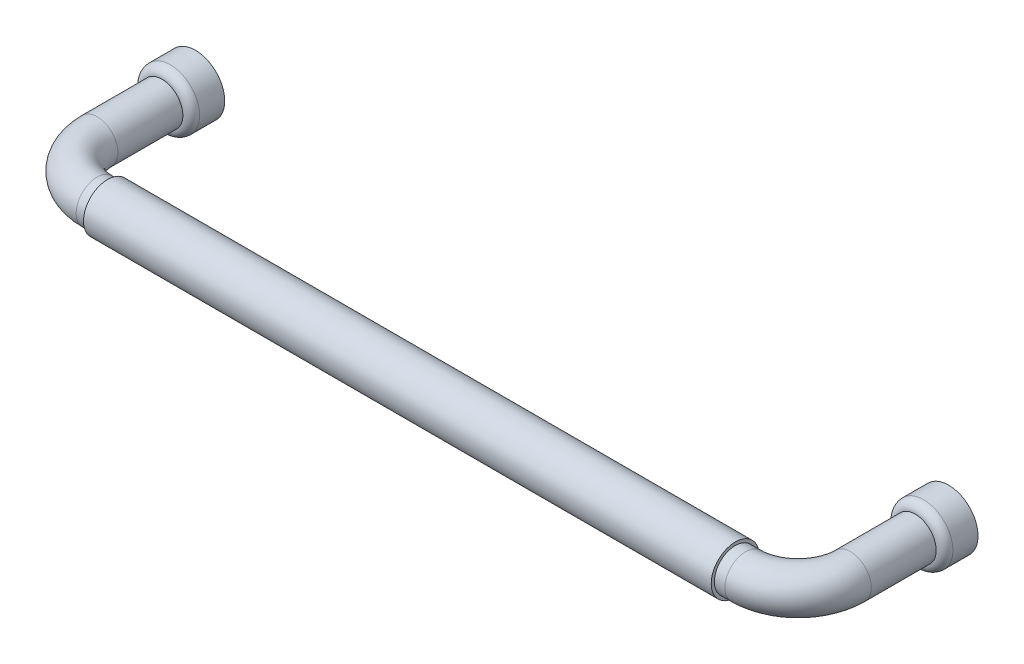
ISO-10303-21;
HEADER;
FILE_DESCRIPTION(('STEP AP214'),'2;1');
FILE_NAME('part.step','',(''),(''),'','','');
FILE_SCHEMA(('AUTOMOTIVE_DESIGN { 1 0 10303 214 1 1 1 1 }'));
ENDSEC;
DATA;
#1=APPLICATION_CONTEXT('core data for automotive mechanical design processes');
#2=APPLICATION_PROTOCOL_DEFINITION('international standard','automotive_design',2000,#1);
#3=PRODUCT_CONTEXT('',#1,'mechanical');
#4=PRODUCT('Part','Part','',(#3));
#5=PRODUCT_RELATED_PRODUCT_CATEGORY('part','',(#4));
#6=PRODUCT_DEFINITION_FORMATION('','',#4);
#7=PRODUCT_DEFINITION_CONTEXT('part definition',#1,'design');
#8=PRODUCT_DEFINITION('design','',#6,#7);
#9=PRODUCT_DEFINITION_SHAPE('','',#8);
#10=(LENGTH_UNIT() NAMED_UNIT(*) SI_UNIT(.MILLI.,.METRE.));
#11=(NAMED_UNIT(*) PLANE_ANGLE_UNIT() SI_UNIT($,.RADIAN.));
#12=(NAMED_UNIT(*) SI_UNIT($,.STERADIAN.) SOLID_ANGLE_UNIT());
#13=UNCERTAINTY_MEASURE_WITH_UNIT(LENGTH_MEASURE(1.E-05),#10,'distance_accuracy_value','');
#14=(GEOMETRIC_REPRESENTATION_CONTEXT(3) GLOBAL_UNCERTAINTY_ASSIGNED_CONTEXT((#13)) GLOBAL_UNIT_ASSIGNED_CONTEXT((#10,
#11,#12)) REPRESENTATION_CONTEXT('',''));
#15=CARTESIAN_POINT('',(0.,0.,0.));
#16=DIRECTION('',(0.,0.,1.));
#17=DIRECTION('',(1.,0.,0.));
#18=AXIS2_PLACEMENT_3D('',#15,#16,#17);
#19=CARTESIAN_POINT('',(0.,0.,0.));
#20=DIRECTION('',(0.,0.,-1.));
#21=DIRECTION('',(0.,1.,0.));
#22=AXIS2_PLACEMENT_3D('',#19,#20,#21);
#23=PLANE('',#22);
#24=CARTESIAN_POINT('',(0.,0.,0.));
#25=DIRECTION('',(0.,0.,1.));
#26=DIRECTION('',(0.,-1.,0.));
#27=AXIS2_PLACEMENT_3D('',#24,#25,#26);
#28=CIRCLE('',#27,7.00045758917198);
#29=CARTESIAN_POINT('',(0.,-7.00045758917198,0.));
#30=VERTEX_POINT('',#29);
#31=EDGE_CURVE('E295',#30,#30,#28,.T.);
#32=ORIENTED_EDGE('',*,*,#31,.F.);
#33=EDGE_LOOP('',(#32));
#34=FACE_BOUND('',#33,.T.);
#35=CARTESIAN_POINT('',(0.,0.,0.));
#36=DIRECTION('',(0.,0.,1.));
#37=DIRECTION('',(0.,-1.,0.));
#38=AXIS2_PLACEMENT_3D('',#35,#36,#37);
#39=CIRCLE('',#38,2.5);
#40=CARTESIAN_POINT('',(0.,-2.5,0.));
#41=VERTEX_POINT('',#40);
#42=EDGE_CURVE('E285',#41,#41,#39,.T.);
#43=ORIENTED_EDGE('',*,*,#42,.T.);
#44=EDGE_LOOP('',(#43));
#45=FACE_BOUND('',#44,.T.);
#46=ADVANCED_FACE('F12',(#34,#45),#23,.T.);
#47=CARTESIAN_POINT('',(167.5,0.,36.));
#48=DIRECTION('',(-1.,0.,0.));
#49=DIRECTION('',(0.,-1.,0.));
#50=AXIS2_PLACEMENT_3D('',#47,#48,#49);
#51=CYLINDRICAL_SURFACE('',#50,5.);
#52=CARTESIAN_POINT('',(165.,0.,36.));
#53=DIRECTION('',(1.,0.,0.));
#54=DIRECTION('',(0.,1.,0.));
#55=AXIS2_PLACEMENT_3D('',#52,#53,#54);
#56=CIRCLE('',#55,5.);
#57=CARTESIAN_POINT('',(165.,5.,36.));
#58=VERTEX_POINT('',#57);
#59=EDGE_CURVE('E19',#58,#58,#56,.F.);
#60=ORIENTED_EDGE('',*,*,#59,.F.);
#61=EDGE_LOOP('',(#60));
#62=FACE_BOUND('',#61,.T.);
#63=CARTESIAN_POINT('',(167.5,0.,36.));
#64=DIRECTION('',(-1.,0.,0.));
#65=DIRECTION('',(0.,1.,0.));
#66=AXIS2_PLACEMENT_3D('',#63,#64,#65);
#67=CIRCLE('',#66,5.);
#68=CARTESIAN_POINT('',(167.5,0.,41.));
#69=VERTEX_POINT('',#68);
#70=EDGE_CURVE('E55',#69,#69,#67,.T.);
#71=ORIENTED_EDGE('',*,*,#70,.T.);
#72=EDGE_LOOP('',(#71));
#73=FACE_BOUND('',#72,.T.);
#74=ADVANCED_FACE('F77',(#62,#73),#51,.T.);
#75=CARTESIAN_POINT('',(167.5,0.,23.5));
#76=DIRECTION('',(0.,-1.,0.));
#77=DIRECTION('',(1.,0.,0.));
#78=AXIS2_PLACEMENT_3D('',#75,#76,#77);
#79=TOROIDAL_SURFACE('',#78,12.5,5.);
#80=CARTESIAN_POINT('',(180.,0.,23.5));
#81=DIRECTION('',(0.,0.,1.));
#82=DIRECTION('',(0.,1.,0.));
#83=AXIS2_PLACEMENT_3D('',#80,#81,#82);
#84=CIRCLE('',#83,5.);
#85=CARTESIAN_POINT('',(185.,0.,23.5));
#86=VERTEX_POINT('',#85);
#87=EDGE_CURVE('E52',#86,#86,#84,.T.);
#88=CARTESIAN_POINT('',(167.5,0.,23.5));
#89=DIRECTION('',(0.,-1.,0.));
#90=DIRECTION('',(1.,0.,0.));
#91=AXIS2_PLACEMENT_3D('',#88,#89,#90);
#92=CIRCLE('',#91,17.5);
#93=EDGE_CURVE('',#86,#69,#92,.T.);
#94=ORIENTED_EDGE('',*,*,#87,.T.);
#95=ORIENTED_EDGE('',*,*,#70,.F.);
#96=ORIENTED_EDGE('',*,*,#93,.T.);
#97=ORIENTED_EDGE('',*,*,#93,.F.);
#98=EDGE_LOOP('',(#94,#96,#95,#97));
#99=FACE_BOUND('',#98,.T.);
#100=ADVANCED_FACE('F87',(#99),#79,.T.);
#101=CARTESIAN_POINT('',(180.,0.,23.5));
#102=DIRECTION('',(0.,0.,-1.));
#103=DIRECTION('',(0.,-1.,0.));
#104=AXIS2_PLACEMENT_3D('',#101,#102,#103);
#105=CYLINDRICAL_SURFACE('',#104,5.);
#106=CARTESIAN_POINT('',(180.,0.,7.99921137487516));
#107=DIRECTION('',(0.,0.,1.));
#108=DIRECTION('',(0.,1.,0.));
#109=AXIS2_PLACEMENT_3D('',#106,#107,#108);
#110=CIRCLE('',#109,5.);
#111=CARTESIAN_POINT('',(180.,5.,7.99921137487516));
#112=VERTEX_POINT('',#111);
#113=EDGE_CURVE('E31',#112,#112,#110,.T.);
#114=ORIENTED_EDGE('',*,*,#113,.T.);
#115=EDGE_LOOP('',(#114));
#116=FACE_BOUND('',#115,.T.);
#117=ORIENTED_EDGE('',*,*,#87,.F.);
#118=EDGE_LOOP('',(#117));
#119=FACE_BOUND('',#118,.T.);
#120=ADVANCED_FACE('F95',(#116,#119),#105,.T.);
#121=CARTESIAN_POINT('',(165.,0.,36.));
#122=DIRECTION('',(1.,0.,0.));
#123=DIRECTION('',(0.,1.,0.));
#124=AXIS2_PLACEMENT_3D('',#121,#122,#123);
#125=PLANE('',#124);
#126=ORIENTED_EDGE('',*,*,#59,.T.);
#127=EDGE_LOOP('',(#126));
#128=FACE_BOUND('',#127,.T.);
#129=CARTESIAN_POINT('',(165.,0.,36.));
#130=DIRECTION('',(1.,0.,0.));
#131=DIRECTION('',(0.,1.,0.));
#132=AXIS2_PLACEMENT_3D('',#129,#130,#131);
#133=CIRCLE('',#132,5.75);
#134=CARTESIAN_POINT('',(165.,5.75,36.));
#135=VERTEX_POINT('',#134);
#136=EDGE_CURVE('E38',#135,#135,#133,.T.);
#137=ORIENTED_EDGE('',*,*,#136,.T.);
#138=EDGE_LOOP('',(#137));
#139=FACE_BOUND('',#138,.T.);
#140=ADVANCED_FACE('F98',(#128,#139),#125,.T.);
#141=CARTESIAN_POINT('',(105.885269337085,0.,36.));
#142=DIRECTION('',(1.,0.,0.));
#143=DIRECTION('',(0.,1.,0.));
#144=AXIS2_PLACEMENT_3D('',#141,#142,#143);
#145=CYLINDRICAL_SURFACE('',#144,5.75);
#146=ORIENTED_EDGE('',*,*,#136,.F.);
#147=EDGE_LOOP('',(#146));
#148=FACE_BOUND('',#147,.T.);
#149=CARTESIAN_POINT('',(15.,0.,36.));
#150=DIRECTION('',(1.,0.,0.));
#151=DIRECTION('',(0.,1.,0.));
#152=AXIS2_PLACEMENT_3D('',#149,#150,#151);
#153=CIRCLE('',#152,5.75);
#154=CARTESIAN_POINT('',(15.,5.75,36.));
#155=VERTEX_POINT('',#154);
#156=EDGE_CURVE('E33',#155,#155,#153,.T.);
#157=ORIENTED_EDGE('',*,*,#156,.T.);
#158=EDGE_LOOP('',(#157));
#159=FACE_BOUND('',#158,.T.);
#160=ADVANCED_FACE('F127',(#148,#159),#145,.T.);
#161=CARTESIAN_POINT('',(15.,0.,41.75));
#162=DIRECTION('',(-1.,0.,0.));
#163=DIRECTION('',(0.,-1.,0.));
#164=AXIS2_PLACEMENT_3D('',#161,#162,#163);
#165=PLANE('',#164);
#166=CARTESIAN_POINT('',(15.,0.,36.));
#167=DIRECTION('',(-1.,0.,0.));
#168=DIRECTION('',(0.,-1.,0.));
#169=AXIS2_PLACEMENT_3D('',#166,#167,#168);
#170=CIRCLE('',#169,5.);
#171=CARTESIAN_POINT('',(15.,-5.,36.));
#172=VERTEX_POINT('',#171);
#173=EDGE_CURVE('E23',#172,#172,#170,.F.);
#174=ORIENTED_EDGE('',*,*,#173,.T.);
#175=EDGE_LOOP('',(#174));
#176=FACE_BOUND('',#175,.T.);
#177=ORIENTED_EDGE('',*,*,#156,.F.);
#178=EDGE_LOOP('',(#177));
#179=FACE_BOUND('',#178,.T.);
#180=ADVANCED_FACE('F78',(#176,#179),#165,.T.);
#181=CARTESIAN_POINT('',(0.,0.,23.5));
#182=DIRECTION('',(0.,0.,-1.));
#183=DIRECTION('',(0.,-1.,0.));
#184=AXIS2_PLACEMENT_3D('',#181,#182,#183);
#185=CYLINDRICAL_SURFACE('',#184,5.);
#186=CARTESIAN_POINT('',(0.,0.,7.99921137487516));
#187=DIRECTION('',(0.,0.,1.));
#188=DIRECTION('',(0.,1.,0.));
#189=AXIS2_PLACEMENT_3D('',#186,#187,#188);
#190=CIRCLE('',#189,5.);
#191=CARTESIAN_POINT('',(0.,5.,7.99921137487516));
#192=VERTEX_POINT('',#191);
#193=EDGE_CURVE('E8',#192,#192,#190,.F.);
#194=ORIENTED_EDGE('',*,*,#193,.F.);
#195=EDGE_LOOP('',(#194));
#196=FACE_BOUND('',#195,.T.);
#197=CARTESIAN_POINT('',(0.,0.,23.5));
#198=DIRECTION('',(0.,0.,-1.));
#199=DIRECTION('',(0.,1.,0.));
#200=AXIS2_PLACEMENT_3D('',#197,#198,#199);
#201=CIRCLE('',#200,5.);
#202=CARTESIAN_POINT('',(-5.,0.,23.5));
#203=VERTEX_POINT('',#202);
#204=EDGE_CURVE('E28',#203,#203,#201,.T.);
#205=ORIENTED_EDGE('',*,*,#204,.T.);
#206=EDGE_LOOP('',(#205));
#207=FACE_BOUND('',#206,.T.);
#208=ADVANCED_FACE('F14',(#196,#207),#185,.T.);
#209=CARTESIAN_POINT('',(12.5,0.,23.5));
#210=DIRECTION('',(0.,-1.,0.));
#211=DIRECTION('',(1.,0.,0.));
#212=AXIS2_PLACEMENT_3D('',#209,#210,#211);
#213=TOROIDAL_SURFACE('',#212,12.5,5.);
#214=CARTESIAN_POINT('',(12.5,0.,36.));
#215=DIRECTION('',(-1.,0.,0.));
#216=DIRECTION('',(0.,1.,0.));
#217=AXIS2_PLACEMENT_3D('',#214,#215,#216);
#218=CIRCLE('',#217,5.);
#219=CARTESIAN_POINT('',(12.5,0.,41.));
#220=VERTEX_POINT('',#219);
#221=EDGE_CURVE('E58',#220,#220,#218,.T.);
#222=CARTESIAN_POINT('',(12.5,0.,23.5));
#223=DIRECTION('',(0.,-1.,0.));
#224=DIRECTION('',(1.,0.,0.));
#225=AXIS2_PLACEMENT_3D('',#222,#223,#224);
#226=CIRCLE('',#225,17.5);
#227=EDGE_CURVE('',#220,#203,#226,.T.);
#228=ORIENTED_EDGE('',*,*,#221,.T.);
#229=ORIENTED_EDGE('',*,*,#204,.F.);
#230=ORIENTED_EDGE('',*,*,#227,.T.);
#231=ORIENTED_EDGE('',*,*,#227,.F.);
#232=EDGE_LOOP('',(#228,#230,#229,#231));
#233=FACE_BOUND('',#232,.T.);
#234=ADVANCED_FACE('F64',(#233),#213,.T.);
#235=ORIENTED_EDGE('',*,*,#173,.F.);
#236=EDGE_LOOP('',(#235));
#237=FACE_BOUND('',#236,.T.);
#238=ORIENTED_EDGE('',*,*,#221,.F.);
#239=EDGE_LOOP('',(#238));
#240=FACE_BOUND('',#239,.T.);
#241=ADVANCED_FACE('F66',(#237,#240),#51,.T.);
#242=CARTESIAN_POINT('',(174.999542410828,0.,7.99921137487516));
#243=DIRECTION('',(0.,0.,1.));
#244=DIRECTION('',(0.,1.,0.));
#245=AXIS2_PLACEMENT_3D('',#242,#243,#244);
#246=PLANE('',#245);
#247=CARTESIAN_POINT('',(180.,0.,7.99921137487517));
#248=DIRECTION('',(0.,0.,-1.));
#249=DIRECTION('',(0.,-1.,0.));
#250=AXIS2_PLACEMENT_3D('',#247,#248,#249);
#251=CIRCLE('',#250,5.00045758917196);
#252=CARTESIAN_POINT('',(180.,-5.00045758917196,7.99921137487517));
#253=VERTEX_POINT('',#252);
#254=EDGE_CURVE('E46',#253,#253,#251,.T.);
#255=ORIENTED_EDGE('',*,*,#254,.F.);
#256=EDGE_LOOP('',(#255));
#257=FACE_BOUND('',#256,.T.);
#258=ORIENTED_EDGE('',*,*,#113,.F.);
#259=EDGE_LOOP('',(#258));
#260=FACE_BOUND('',#259,.T.);
#261=ADVANCED_FACE('F74',(#257,#260),#246,.T.);
#262=CARTESIAN_POINT('',(180.,0.,0.));
#263=DIRECTION('',(0.,0.,-1.));
#264=DIRECTION('',(0.,-1.,0.));
#265=AXIS2_PLACEMENT_3D('',#262,#263,#264);
#266=CYLINDRICAL_SURFACE('',#265,7.00045758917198);
#267=CARTESIAN_POINT('',(180.,0.,5.99921137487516));
#268=DIRECTION('',(0.,0.,-1.));
#269=DIRECTION('',(0.,-1.,0.));
#270=AXIS2_PLACEMENT_3D('',#267,#268,#269);
#271=CIRCLE('',#270,7.00045758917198);
#272=CARTESIAN_POINT('',(180.,-7.00045758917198,5.99921137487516));
#273=VERTEX_POINT('',#272);
#274=EDGE_CURVE('E41',#273,#273,#271,.T.);
#275=ORIENTED_EDGE('',*,*,#274,.T.);
#276=EDGE_LOOP('',(#275));
#277=FACE_BOUND('',#276,.T.);
#278=CARTESIAN_POINT('',(180.,0.,0.));
#279=DIRECTION('',(0.,0.,-1.));
#280=DIRECTION('',(0.,-1.,0.));
#281=AXIS2_PLACEMENT_3D('',#278,#279,#280);
#282=CIRCLE('',#281,7.00045758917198);
#283=CARTESIAN_POINT('',(180.,-7.00045758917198,0.));
#284=VERTEX_POINT('',#283);
#285=EDGE_CURVE('E34',#284,#284,#282,.T.);
#286=ORIENTED_EDGE('',*,*,#285,.F.);
#287=EDGE_LOOP('',(#286));
#288=FACE_BOUND('',#287,.T.);
#289=ADVANCED_FACE('F181',(#277,#288),#266,.T.);
#290=CARTESIAN_POINT('',(180.,0.,5.99921137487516));
#291=DIRECTION('',(0.,0.,-1.));
#292=DIRECTION('',(0.,-1.,0.));
#293=AXIS2_PLACEMENT_3D('',#290,#291,#292);
#294=TOROIDAL_SURFACE('',#293,5.00045758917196,2.);
#295=ORIENTED_EDGE('',*,*,#254,.T.);
#296=EDGE_LOOP('',(#295));
#297=FACE_BOUND('',#296,.T.);
#298=ORIENTED_EDGE('',*,*,#274,.F.);
#299=EDGE_LOOP('',(#298));
#300=FACE_BOUND('',#299,.T.);
#301=ADVANCED_FACE('F189',(#297,#300),#294,.T.);
#302=CARTESIAN_POINT('',(180.,0.,0.));
#303=DIRECTION('',(0.,0.,1.));
#304=DIRECTION('',(0.,1.,0.));
#305=AXIS2_PLACEMENT_3D('',#302,#303,#304);
#306=PLANE('',#305);
#307=CARTESIAN_POINT('',(180.,0.,0.));
#308=DIRECTION('',(0.,0.,-1.));
#309=DIRECTION('',(0.,-1.,0.));
#310=AXIS2_PLACEMENT_3D('',#307,#308,#309);
#311=CIRCLE('',#310,2.5);
#312=CARTESIAN_POINT('',(180.,-2.5,0.));
#313=VERTEX_POINT('',#312);
#314=EDGE_CURVE('E298',#313,#313,#311,.T.);
#315=ORIENTED_EDGE('',*,*,#314,.F.);
#316=EDGE_LOOP('',(#315));
#317=FACE_BOUND('',#316,.T.);
#318=ORIENTED_EDGE('',*,*,#285,.T.);
#319=EDGE_LOOP('',(#318));
#320=FACE_BOUND('',#319,.T.);
#321=ADVANCED_FACE('F93',(#317,#320),#306,.F.);
#322=CARTESIAN_POINT('',(180.,0.,11.));
#323=DIRECTION('',(0.,0.,-1.));
#324=DIRECTION('',(0.,-1.,0.));
#325=AXIS2_PLACEMENT_3D('',#322,#323,#324);
#326=CYLINDRICAL_SURFACE('',#325,2.5);
#327=CARTESIAN_POINT('',(180.,0.,11.));
#328=DIRECTION('',(0.,0.,-1.));
#329=DIRECTION('',(0.,-1.,0.));
#330=AXIS2_PLACEMENT_3D('',#327,#328,#329);
#331=CIRCLE('',#330,2.5);
#332=CARTESIAN_POINT('',(180.,-2.5,11.));
#333=VERTEX_POINT('',#332);
#334=EDGE_CURVE('E301',#333,#333,#331,.T.);
#335=ORIENTED_EDGE('',*,*,#334,.F.);
#336=EDGE_LOOP('',(#335));
#337=FACE_BOUND('',#336,.T.);
#338=ORIENTED_EDGE('',*,*,#314,.T.);
#339=EDGE_LOOP('',(#338));
#340=FACE_BOUND('',#339,.T.);
#341=ADVANCED_FACE('F206',(#337,#340),#326,.F.);
#342=CARTESIAN_POINT('',(180.,0.,11.));
#343=DIRECTION('',(0.,0.,-1.));
#344=DIRECTION('',(0.,-1.,0.));
#345=AXIS2_PLACEMENT_3D('',#342,#343,#344);
#346=PLANE('',#345);
#347=ORIENTED_EDGE('',*,*,#334,.T.);
#348=EDGE_LOOP('',(#347));
#349=FACE_BOUND('',#348,.T.);
#350=ADVANCED_FACE('F208',(#349),#346,.T.);
#351=CARTESIAN_POINT('',(0.,0.,0.));
#352=DIRECTION('',(0.,0.,-1.));
#353=DIRECTION('',(0.,-1.,0.));
#354=AXIS2_PLACEMENT_3D('',#351,#352,#353);
#355=CYLINDRICAL_SURFACE('',#354,7.00045758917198);
#356=CARTESIAN_POINT('',(0.,0.,5.99921137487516));
#357=DIRECTION('',(0.,0.,1.));
#358=DIRECTION('',(0.,-1.,0.));
#359=AXIS2_PLACEMENT_3D('',#356,#357,#358);
#360=CIRCLE('',#359,7.00045758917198);
#361=CARTESIAN_POINT('',(0.,-7.00045758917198,5.99921137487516));
#362=VERTEX_POINT('',#361);
#363=EDGE_CURVE('E288',#362,#362,#360,.T.);
#364=ORIENTED_EDGE('',*,*,#363,.F.);
#365=EDGE_LOOP('',(#364));
#366=FACE_BOUND('',#365,.T.);
#367=ORIENTED_EDGE('',*,*,#31,.T.);
#368=EDGE_LOOP('',(#367));
#369=FACE_BOUND('',#368,.T.);
#370=ADVANCED_FACE('F217',(#366,#369),#355,.T.);
#371=CARTESIAN_POINT('',(0.,0.,5.99921137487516));
#372=DIRECTION('',(0.,0.,-1.));
#373=DIRECTION('',(0.,-1.,0.));
#374=AXIS2_PLACEMENT_3D('',#371,#372,#373);
#375=TOROIDAL_SURFACE('',#374,5.00045758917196,2.);
#376=CARTESIAN_POINT('',(0.,0.,7.99921137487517));
#377=DIRECTION('',(0.,0.,1.));
#378=DIRECTION('',(0.,-1.,0.));
#379=AXIS2_PLACEMENT_3D('',#376,#377,#378);
#380=CIRCLE('',#379,5.00045758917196);
#381=CARTESIAN_POINT('',(0.,-5.00045758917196,7.99921137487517));
#382=VERTEX_POINT('',#381);
#383=EDGE_CURVE('E284',#382,#382,#380,.T.);
#384=ORIENTED_EDGE('',*,*,#383,.F.);
#385=EDGE_LOOP('',(#384));
#386=FACE_BOUND('',#385,.T.);
#387=ORIENTED_EDGE('',*,*,#363,.T.);
#388=EDGE_LOOP('',(#387));
#389=FACE_BOUND('',#388,.T.);
#390=ADVANCED_FACE('F232',(#386,#389),#375,.T.);
#391=CARTESIAN_POINT('',(5.00045758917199,0.,7.99921137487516));
#392=DIRECTION('',(0.,0.,1.));
#393=DIRECTION('',(0.,1.,0.));
#394=AXIS2_PLACEMENT_3D('',#391,#392,#393);
#395=PLANE('',#394);
#396=ORIENTED_EDGE('',*,*,#193,.T.);
#397=EDGE_LOOP('',(#396));
#398=FACE_BOUND('',#397,.T.);
#399=ORIENTED_EDGE('',*,*,#383,.T.);
#400=EDGE_LOOP('',(#399));
#401=FACE_BOUND('',#400,.T.);
#402=ADVANCED_FACE('F241',(#398,#401),#395,.T.);
#403=CARTESIAN_POINT('',(0.,0.,11.));
#404=DIRECTION('',(0.,0.,-1.));
#405=DIRECTION('',(0.,-1.,0.));
#406=AXIS2_PLACEMENT_3D('',#403,#404,#405);
#407=CYLINDRICAL_SURFACE('',#406,2.5);
#408=CARTESIAN_POINT('',(0.,0.,11.));
#409=DIRECTION('',(0.,0.,1.));
#410=DIRECTION('',(0.,-1.,0.));
#411=AXIS2_PLACEMENT_3D('',#408,#409,#410);
#412=CIRCLE('',#411,2.5);
#413=CARTESIAN_POINT('',(0.,-2.5,11.));
#414=VERTEX_POINT('',#413);
#415=EDGE_CURVE('E283',#414,#414,#412,.T.);
#416=ORIENTED_EDGE('',*,*,#415,.T.);
#417=EDGE_LOOP('',(#416));
#418=FACE_BOUND('',#417,.T.);
#419=ORIENTED_EDGE('',*,*,#42,.F.);
#420=EDGE_LOOP('',(#419));
#421=FACE_BOUND('',#420,.T.);
#422=ADVANCED_FACE('F250',(#418,#421),#407,.F.);
#423=CARTESIAN_POINT('',(0.,0.,11.));
#424=DIRECTION('',(0.,0.,-1.));
#425=DIRECTION('',(0.,-1.,0.));
#426=AXIS2_PLACEMENT_3D('',#423,#424,#425);
#427=PLANE('',#426);
#428=ORIENTED_EDGE('',*,*,#415,.F.);
#429=EDGE_LOOP('',(#428));
#430=FACE_BOUND('',#429,.T.);
#431=ADVANCED_FACE('F252',(#430),#427,.T.);
#432=CLOSED_SHELL('',(#46,#74,#100,#120,#140,#160,#180,#208,#234,#241,#261,#289,#301,#321,#341,
#350,#370,#390,#402,#422,#431));
#433=MANIFOLD_SOLID_BREP('B1',#432);
#434=ADVANCED_BREP_SHAPE_REPRESENTATION('',(#18,#433),#14);
#435=SHAPE_DEFINITION_REPRESENTATION(#9,#434);
ENDSEC;
END-ISO-10303-21;
